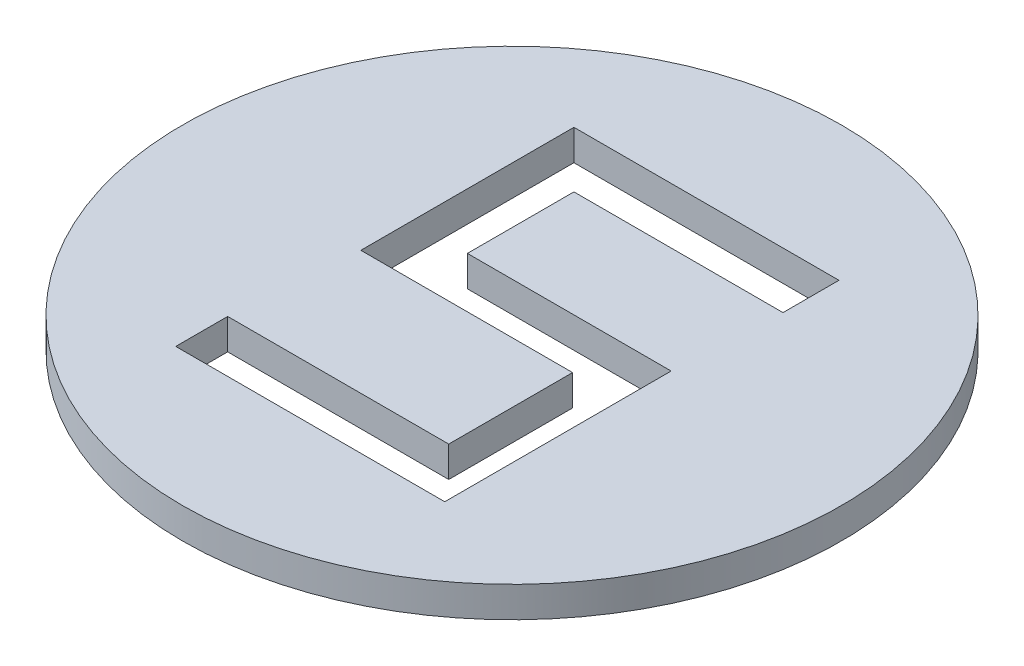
ISO-10303-21;
HEADER;
FILE_DESCRIPTION(('STEP AP214'),'2;1');
FILE_NAME('part.step','',(''),(''),'','','');
FILE_SCHEMA(('AUTOMOTIVE_DESIGN { 1 0 10303 214 1 1 1 1 }'));
ENDSEC;
DATA;
#1=APPLICATION_CONTEXT('core data for automotive mechanical design processes');
#2=APPLICATION_PROTOCOL_DEFINITION('international standard','automotive_design',2000,#1);
#3=PRODUCT_CONTEXT('',#1,'mechanical');
#4=PRODUCT('Part','Part','',(#3));
#5=PRODUCT_RELATED_PRODUCT_CATEGORY('part','',(#4));
#6=PRODUCT_DEFINITION_FORMATION('','',#4);
#7=PRODUCT_DEFINITION_CONTEXT('part definition',#1,'design');
#8=PRODUCT_DEFINITION('design','',#6,#7);
#9=PRODUCT_DEFINITION_SHAPE('','',#8);
#10=(LENGTH_UNIT() NAMED_UNIT(*) SI_UNIT(.MILLI.,.METRE.));
#11=(NAMED_UNIT(*) PLANE_ANGLE_UNIT() SI_UNIT($,.RADIAN.));
#12=(NAMED_UNIT(*) SI_UNIT($,.STERADIAN.) SOLID_ANGLE_UNIT());
#13=UNCERTAINTY_MEASURE_WITH_UNIT(LENGTH_MEASURE(1.E-05),#10,'distance_accuracy_value','');
#14=(GEOMETRIC_REPRESENTATION_CONTEXT(3) GLOBAL_UNCERTAINTY_ASSIGNED_CONTEXT((#13)) GLOBAL_UNIT_ASSIGNED_CONTEXT((#10,
#11,#12)) REPRESENTATION_CONTEXT('',''));
#15=CARTESIAN_POINT('',(0.,0.,0.));
#16=DIRECTION('',(0.,0.,1.));
#17=DIRECTION('',(1.,0.,0.));
#18=AXIS2_PLACEMENT_3D('',#15,#16,#17);
#19=CARTESIAN_POINT('',(0.,4.,-7.73154760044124));
#20=DIRECTION('',(0.,-1.,0.));
#21=DIRECTION('',(0.,0.,-1.));
#22=AXIS2_PLACEMENT_3D('',#19,#20,#21);
#23=CYLINDRICAL_SURFACE('',#22,42.9395292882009);
#24=CARTESIAN_POINT('',(0.,4.,-7.73154760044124));
#25=DIRECTION('',(0.,1.,0.));
#26=DIRECTION('',(0.,0.,1.));
#27=AXIS2_PLACEMENT_3D('',#24,#25,#26);
#28=CIRCLE('',#27,42.9395292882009);
#29=CARTESIAN_POINT('',(0.,4.,35.2079816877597));
#30=VERTEX_POINT('',#29);
#31=EDGE_CURVE('E11',#30,#30,#28,.T.);
#32=ORIENTED_EDGE('',*,*,#31,.F.);
#33=EDGE_LOOP('',(#32));
#34=FACE_BOUND('',#33,.T.);
#35=CARTESIAN_POINT('',(0.,0.,-7.73154760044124));
#36=DIRECTION('',(0.,1.,0.));
#37=DIRECTION('',(0.,0.,1.));
#38=AXIS2_PLACEMENT_3D('',#35,#36,#37);
#39=CIRCLE('',#38,42.9395292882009);
#40=CARTESIAN_POINT('',(0.,0.,35.2079816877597));
#41=VERTEX_POINT('',#40);
#42=EDGE_CURVE('E36',#41,#41,#39,.T.);
#43=ORIENTED_EDGE('',*,*,#42,.T.);
#44=EDGE_LOOP('',(#43));
#45=FACE_BOUND('',#44,.T.);
#46=ADVANCED_FACE('F33',(#34,#45),#23,.T.);
#47=CARTESIAN_POINT('',(0.,4.,-7.73154760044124));
#48=DIRECTION('',(0.,1.,0.));
#49=DIRECTION('',(0.,0.,1.));
#50=AXIS2_PLACEMENT_3D('',#47,#48,#49);
#51=PLANE('',#50);
#52=DIRECTION('',(0.,0.,-1.));
#53=VECTOR('',#52,1.);
#54=CARTESIAN_POINT('',(17.3517805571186,4.,-25.690640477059));
#55=LINE('',#54,#53);
#56=CARTESIAN_POINT('',(17.3517805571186,4.,-25.690640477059));
#57=VERTEX_POINT('',#56);
#58=CARTESIAN_POINT('',(17.3517805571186,4.,-32.9783883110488));
#59=VERTEX_POINT('',#58);
#60=EDGE_CURVE('E47',#57,#59,#55,.T.);
#61=ORIENTED_EDGE('',*,*,#60,.F.);
#62=DIRECTION('',(1.,0.,0.));
#63=VECTOR('',#62,1.);
#64=CARTESIAN_POINT('',(17.3517805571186,4.,-25.690640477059));
#65=LINE('',#64,#63);
#66=CARTESIAN_POINT('',(-9.8905149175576,4.,-25.690640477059));
#67=VERTEX_POINT('',#66);
#68=EDGE_CURVE('E140',#67,#57,#65,.T.);
#69=ORIENTED_EDGE('',*,*,#68,.F.);
#70=DIRECTION('',(0.,0.,-1.));
#71=VECTOR('',#70,1.);
#72=CARTESIAN_POINT('',(-9.8905149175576,4.,-25.690640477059));
#73=LINE('',#72,#71);
#74=CARTESIAN_POINT('',(-9.8905149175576,4.,-11.8092160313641));
#75=VERTEX_POINT('',#74);
#76=EDGE_CURVE('E143',#75,#67,#73,.T.);
#77=ORIENTED_EDGE('',*,*,#76,.F.);
#78=DIRECTION('',(-1.,0.,0.));
#79=VECTOR('',#78,1.);
#80=CARTESIAN_POINT('',(-9.8905149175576,4.,-11.8092160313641));
#81=LINE('',#80,#79);
#82=CARTESIAN_POINT('',(16.6577093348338,4.,-11.8092160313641));
#83=VERTEX_POINT('',#82);
#84=EDGE_CURVE('E195',#83,#75,#81,.T.);
#85=ORIENTED_EDGE('',*,*,#84,.F.);
#86=DIRECTION('',(0.,0.,-1.));
#87=VECTOR('',#86,1.);
#88=CARTESIAN_POINT('',(16.6577093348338,4.,-11.8092160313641));
#89=LINE('',#88,#87);
#90=CARTESIAN_POINT('',(16.6577093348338,4.,17.6888109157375));
#91=VERTEX_POINT('',#90);
#92=EDGE_CURVE('E192',#91,#83,#89,.T.);
#93=ORIENTED_EDGE('',*,*,#92,.F.);
#94=DIRECTION('',(1.,0.,0.));
#95=VECTOR('',#94,1.);
#96=CARTESIAN_POINT('',(16.6577093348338,4.,17.6888109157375));
#97=LINE('',#96,#95);
#98=CARTESIAN_POINT('',(-18.3928873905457,4.,17.6888109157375));
#99=VERTEX_POINT('',#98);
#100=EDGE_CURVE('E189',#99,#91,#97,.T.);
#101=ORIENTED_EDGE('',*,*,#100,.F.);
#102=DIRECTION('',(0.,0.,1.));
#103=VECTOR('',#102,1.);
#104=CARTESIAN_POINT('',(-18.3928873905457,4.,17.6888109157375));
#105=LINE('',#104,#103);
#106=CARTESIAN_POINT('',(-18.3928873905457,4.,10.9216164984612));
#107=VERTEX_POINT('',#106);
#108=EDGE_CURVE('E186',#107,#99,#105,.T.);
#109=ORIENTED_EDGE('',*,*,#108,.F.);
#110=DIRECTION('',(-1.,0.,0.));
#111=VECTOR('',#110,1.);
#112=CARTESIAN_POINT('',(10.4110683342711,4.,10.9216164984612));
#113=LINE('',#112,#111);
#114=CARTESIAN_POINT('',(10.4110683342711,4.,10.9216164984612));
#115=VERTEX_POINT('',#114);
#116=EDGE_CURVE('E183',#115,#107,#113,.T.);
#117=ORIENTED_EDGE('',*,*,#116,.F.);
#118=DIRECTION('',(0.,0.,1.));
#119=VECTOR('',#118,1.);
#120=CARTESIAN_POINT('',(10.4110683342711,4.,-5.21553941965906));
#121=LINE('',#120,#119);
#122=CARTESIAN_POINT('',(10.4110683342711,4.,-5.21553941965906));
#123=VERTEX_POINT('',#122);
#124=EDGE_CURVE('E180',#123,#115,#121,.T.);
#125=ORIENTED_EDGE('',*,*,#124,.F.);
#126=DIRECTION('',(1.,0.,0.));
#127=VECTOR('',#126,1.);
#128=CARTESIAN_POINT('',(-17.1782627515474,4.,-5.21553941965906));
#129=LINE('',#128,#127);
#130=CARTESIAN_POINT('',(-17.1782627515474,4.,-5.21553941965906));
#131=VERTEX_POINT('',#130);
#132=EDGE_CURVE('E177',#131,#123,#129,.T.);
#133=ORIENTED_EDGE('',*,*,#132,.F.);
#134=DIRECTION('',(0.,0.,1.));
#135=VECTOR('',#134,1.);
#136=CARTESIAN_POINT('',(-17.1782627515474,4.,-32.9783883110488));
#137=LINE('',#136,#135);
#138=CARTESIAN_POINT('',(-17.1782627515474,4.,-32.9783883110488));
#139=VERTEX_POINT('',#138);
#140=EDGE_CURVE('E174',#139,#131,#137,.T.);
#141=ORIENTED_EDGE('',*,*,#140,.F.);
#142=DIRECTION('',(-1.,0.,0.));
#143=VECTOR('',#142,1.);
#144=CARTESIAN_POINT('',(17.3517805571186,4.,-32.9783883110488));
#145=LINE('',#144,#143);
#146=EDGE_CURVE('E172',#59,#139,#145,.T.);
#147=ORIENTED_EDGE('',*,*,#146,.F.);
#148=EDGE_LOOP('',(#61,#69,#77,#85,#93,#101,#109,#117,#125,#133,#141,#147));
#149=FACE_BOUND('',#148,.T.);
#150=ORIENTED_EDGE('',*,*,#31,.T.);
#151=EDGE_LOOP('',(#150));
#152=FACE_BOUND('',#151,.T.);
#153=ADVANCED_FACE('F224',(#149,#152),#51,.T.);
#154=CARTESIAN_POINT('',(0.,0.,-7.73154760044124));
#155=DIRECTION('',(0.,1.,0.));
#156=DIRECTION('',(0.,0.,1.));
#157=AXIS2_PLACEMENT_3D('',#154,#155,#156);
#158=PLANE('',#157);
#159=DIRECTION('',(1.,0.,0.));
#160=VECTOR('',#159,1.);
#161=CARTESIAN_POINT('',(17.3517805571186,0.,-25.690640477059));
#162=LINE('',#161,#160);
#163=CARTESIAN_POINT('',(-9.8905149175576,0.,-25.690640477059));
#164=VERTEX_POINT('',#163);
#165=CARTESIAN_POINT('',(17.3517805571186,0.,-25.690640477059));
#166=VERTEX_POINT('',#165);
#167=EDGE_CURVE('E129',#164,#166,#162,.T.);
#168=ORIENTED_EDGE('',*,*,#167,.T.);
#169=DIRECTION('',(0.,0.,-1.));
#170=VECTOR('',#169,1.);
#171=CARTESIAN_POINT('',(17.3517805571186,0.,-25.690640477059));
#172=LINE('',#171,#170);
#173=CARTESIAN_POINT('',(17.3517805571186,0.,-32.9783883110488));
#174=VERTEX_POINT('',#173);
#175=EDGE_CURVE('E123',#166,#174,#172,.T.);
#176=ORIENTED_EDGE('',*,*,#175,.T.);
#177=DIRECTION('',(-1.,0.,0.));
#178=VECTOR('',#177,1.);
#179=CARTESIAN_POINT('',(17.3517805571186,0.,-32.9783883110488));
#180=LINE('',#179,#178);
#181=CARTESIAN_POINT('',(-17.1782627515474,0.,-32.9783883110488));
#182=VERTEX_POINT('',#181);
#183=EDGE_CURVE('E132',#174,#182,#180,.T.);
#184=ORIENTED_EDGE('',*,*,#183,.T.);
#185=DIRECTION('',(0.,0.,1.));
#186=VECTOR('',#185,1.);
#187=CARTESIAN_POINT('',(-17.1782627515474,0.,-32.9783883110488));
#188=LINE('',#187,#186);
#189=CARTESIAN_POINT('',(-17.1782627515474,0.,-5.21553941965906));
#190=VERTEX_POINT('',#189);
#191=EDGE_CURVE('E55',#182,#190,#188,.T.);
#192=ORIENTED_EDGE('',*,*,#191,.T.);
#193=DIRECTION('',(1.,0.,0.));
#194=VECTOR('',#193,1.);
#195=CARTESIAN_POINT('',(-17.1782627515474,0.,-5.21553941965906));
#196=LINE('',#195,#194);
#197=CARTESIAN_POINT('',(10.4110683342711,0.,-5.21553941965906));
#198=VERTEX_POINT('',#197);
#199=EDGE_CURVE('E147',#190,#198,#196,.T.);
#200=ORIENTED_EDGE('',*,*,#199,.T.);
#201=DIRECTION('',(0.,0.,1.));
#202=VECTOR('',#201,1.);
#203=CARTESIAN_POINT('',(10.4110683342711,0.,-5.21553941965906));
#204=LINE('',#203,#202);
#205=CARTESIAN_POINT('',(10.4110683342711,0.,10.9216164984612));
#206=VERTEX_POINT('',#205);
#207=EDGE_CURVE('E150',#198,#206,#204,.T.);
#208=ORIENTED_EDGE('',*,*,#207,.T.);
#209=DIRECTION('',(-1.,0.,0.));
#210=VECTOR('',#209,1.);
#211=CARTESIAN_POINT('',(10.4110683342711,0.,10.9216164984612));
#212=LINE('',#211,#210);
#213=CARTESIAN_POINT('',(-18.3928873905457,0.,10.9216164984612));
#214=VERTEX_POINT('',#213);
#215=EDGE_CURVE('E153',#206,#214,#212,.T.);
#216=ORIENTED_EDGE('',*,*,#215,.T.);
#217=DIRECTION('',(0.,0.,1.));
#218=VECTOR('',#217,1.);
#219=CARTESIAN_POINT('',(-18.3928873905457,0.,17.6888109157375));
#220=LINE('',#219,#218);
#221=CARTESIAN_POINT('',(-18.3928873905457,0.,17.6888109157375));
#222=VERTEX_POINT('',#221);
#223=EDGE_CURVE('E156',#214,#222,#220,.T.);
#224=ORIENTED_EDGE('',*,*,#223,.T.);
#225=DIRECTION('',(1.,0.,0.));
#226=VECTOR('',#225,1.);
#227=CARTESIAN_POINT('',(16.6577093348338,0.,17.6888109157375));
#228=LINE('',#227,#226);
#229=CARTESIAN_POINT('',(16.6577093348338,0.,17.6888109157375));
#230=VERTEX_POINT('',#229);
#231=EDGE_CURVE('E159',#222,#230,#228,.T.);
#232=ORIENTED_EDGE('',*,*,#231,.T.);
#233=DIRECTION('',(0.,0.,-1.));
#234=VECTOR('',#233,1.);
#235=CARTESIAN_POINT('',(16.6577093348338,0.,-11.8092160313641));
#236=LINE('',#235,#234);
#237=CARTESIAN_POINT('',(16.6577093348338,0.,-11.8092160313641));
#238=VERTEX_POINT('',#237);
#239=EDGE_CURVE('E162',#230,#238,#236,.T.);
#240=ORIENTED_EDGE('',*,*,#239,.T.);
#241=DIRECTION('',(-1.,0.,0.));
#242=VECTOR('',#241,1.);
#243=CARTESIAN_POINT('',(-9.8905149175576,0.,-11.8092160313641));
#244=LINE('',#243,#242);
#245=CARTESIAN_POINT('',(-9.8905149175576,0.,-11.8092160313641));
#246=VERTEX_POINT('',#245);
#247=EDGE_CURVE('E165',#238,#246,#244,.T.);
#248=ORIENTED_EDGE('',*,*,#247,.T.);
#249=DIRECTION('',(0.,0.,-1.));
#250=VECTOR('',#249,1.);
#251=CARTESIAN_POINT('',(-9.8905149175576,0.,-25.690640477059));
#252=LINE('',#251,#250);
#253=EDGE_CURVE('E168',#246,#164,#252,.T.);
#254=ORIENTED_EDGE('',*,*,#253,.T.);
#255=EDGE_LOOP('',(#168,#176,#184,#192,#200,#208,#216,#224,#232,#240,#248,#254));
#256=FACE_BOUND('',#255,.T.);
#257=ORIENTED_EDGE('',*,*,#42,.F.);
#258=EDGE_LOOP('',(#257));
#259=FACE_BOUND('',#258,.T.);
#260=ADVANCED_FACE('F136',(#256,#259),#158,.F.);
#261=CARTESIAN_POINT('',(17.3517805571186,0.,-25.690640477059));
#262=DIRECTION('',(1.,0.,0.));
#263=DIRECTION('',(0.,0.,-1.));
#264=AXIS2_PLACEMENT_3D('',#261,#262,#263);
#265=PLANE('',#264);
#266=ORIENTED_EDGE('',*,*,#60,.T.);
#267=DIRECTION('',(0.,1.,0.));
#268=VECTOR('',#267,1.);
#269=CARTESIAN_POINT('',(17.3517805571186,0.,-32.9783883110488));
#270=LINE('',#269,#268);
#271=EDGE_CURVE('E119',#174,#59,#270,.T.);
#272=ORIENTED_EDGE('',*,*,#271,.F.);
#273=ORIENTED_EDGE('',*,*,#175,.F.);
#274=DIRECTION('',(0.,1.,0.));
#275=VECTOR('',#274,1.);
#276=CARTESIAN_POINT('',(17.3517805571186,0.,-25.690640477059));
#277=LINE('',#276,#275);
#278=EDGE_CURVE('E200',#166,#57,#277,.T.);
#279=ORIENTED_EDGE('',*,*,#278,.T.);
#280=EDGE_LOOP('',(#266,#272,#273,#279));
#281=FACE_BOUND('',#280,.T.);
#282=ADVANCED_FACE('F121',(#281),#265,.F.);
#283=CARTESIAN_POINT('',(17.3517805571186,0.,-25.690640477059));
#284=DIRECTION('',(0.,0.,1.));
#285=DIRECTION('',(1.,0.,0.));
#286=AXIS2_PLACEMENT_3D('',#283,#284,#285);
#287=PLANE('',#286);
#288=ORIENTED_EDGE('',*,*,#68,.T.);
#289=ORIENTED_EDGE('',*,*,#278,.F.);
#290=ORIENTED_EDGE('',*,*,#167,.F.);
#291=DIRECTION('',(0.,1.,0.));
#292=VECTOR('',#291,1.);
#293=CARTESIAN_POINT('',(-9.8905149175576,0.,-25.690640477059));
#294=LINE('',#293,#292);
#295=EDGE_CURVE('E202',#164,#67,#294,.T.);
#296=ORIENTED_EDGE('',*,*,#295,.T.);
#297=EDGE_LOOP('',(#288,#289,#290,#296));
#298=FACE_BOUND('',#297,.T.);
#299=ADVANCED_FACE('F259',(#298),#287,.F.);
#300=CARTESIAN_POINT('',(-9.8905149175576,0.,-25.690640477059));
#301=DIRECTION('',(1.,0.,0.));
#302=DIRECTION('',(0.,0.,-1.));
#303=AXIS2_PLACEMENT_3D('',#300,#301,#302);
#304=PLANE('',#303);
#305=ORIENTED_EDGE('',*,*,#76,.T.);
#306=ORIENTED_EDGE('',*,*,#295,.F.);
#307=ORIENTED_EDGE('',*,*,#253,.F.);
#308=DIRECTION('',(0.,1.,0.));
#309=VECTOR('',#308,1.);
#310=CARTESIAN_POINT('',(-9.8905149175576,0.,-11.8092160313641));
#311=LINE('',#310,#309);
#312=EDGE_CURVE('E204',#246,#75,#311,.T.);
#313=ORIENTED_EDGE('',*,*,#312,.T.);
#314=EDGE_LOOP('',(#305,#306,#307,#313));
#315=FACE_BOUND('',#314,.T.);
#316=ADVANCED_FACE('F255',(#315),#304,.F.);
#317=CARTESIAN_POINT('',(-9.8905149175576,0.,-11.8092160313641));
#318=DIRECTION('',(0.,0.,-1.));
#319=DIRECTION('',(-1.,0.,0.));
#320=AXIS2_PLACEMENT_3D('',#317,#318,#319);
#321=PLANE('',#320);
#322=ORIENTED_EDGE('',*,*,#84,.T.);
#323=ORIENTED_EDGE('',*,*,#312,.F.);
#324=ORIENTED_EDGE('',*,*,#247,.F.);
#325=DIRECTION('',(0.,1.,0.));
#326=VECTOR('',#325,1.);
#327=CARTESIAN_POINT('',(16.6577093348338,0.,-11.8092160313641));
#328=LINE('',#327,#326);
#329=EDGE_CURVE('E206',#238,#83,#328,.T.);
#330=ORIENTED_EDGE('',*,*,#329,.T.);
#331=EDGE_LOOP('',(#322,#323,#324,#330));
#332=FACE_BOUND('',#331,.T.);
#333=ADVANCED_FACE('F252',(#332),#321,.F.);
#334=CARTESIAN_POINT('',(16.6577093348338,0.,-11.8092160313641));
#335=DIRECTION('',(1.,0.,0.));
#336=DIRECTION('',(0.,0.,-1.));
#337=AXIS2_PLACEMENT_3D('',#334,#335,#336);
#338=PLANE('',#337);
#339=ORIENTED_EDGE('',*,*,#92,.T.);
#340=ORIENTED_EDGE('',*,*,#329,.F.);
#341=ORIENTED_EDGE('',*,*,#239,.F.);
#342=DIRECTION('',(0.,1.,0.));
#343=VECTOR('',#342,1.);
#344=CARTESIAN_POINT('',(16.6577093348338,0.,17.6888109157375));
#345=LINE('',#344,#343);
#346=EDGE_CURVE('E208',#230,#91,#345,.T.);
#347=ORIENTED_EDGE('',*,*,#346,.T.);
#348=EDGE_LOOP('',(#339,#340,#341,#347));
#349=FACE_BOUND('',#348,.T.);
#350=ADVANCED_FACE('F248',(#349),#338,.F.);
#351=CARTESIAN_POINT('',(16.6577093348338,0.,17.6888109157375));
#352=DIRECTION('',(0.,0.,1.));
#353=DIRECTION('',(1.,0.,0.));
#354=AXIS2_PLACEMENT_3D('',#351,#352,#353);
#355=PLANE('',#354);
#356=ORIENTED_EDGE('',*,*,#100,.T.);
#357=ORIENTED_EDGE('',*,*,#346,.F.);
#358=ORIENTED_EDGE('',*,*,#231,.F.);
#359=DIRECTION('',(0.,1.,0.));
#360=VECTOR('',#359,1.);
#361=CARTESIAN_POINT('',(-18.3928873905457,0.,17.6888109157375));
#362=LINE('',#361,#360);
#363=EDGE_CURVE('E210',#222,#99,#362,.T.);
#364=ORIENTED_EDGE('',*,*,#363,.T.);
#365=EDGE_LOOP('',(#356,#357,#358,#364));
#366=FACE_BOUND('',#365,.T.);
#367=ADVANCED_FACE('F244',(#366),#355,.F.);
#368=CARTESIAN_POINT('',(-18.3928873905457,0.,17.6888109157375));
#369=DIRECTION('',(-1.,0.,0.));
#370=DIRECTION('',(0.,0.,1.));
#371=AXIS2_PLACEMENT_3D('',#368,#369,#370);
#372=PLANE('',#371);
#373=ORIENTED_EDGE('',*,*,#108,.T.);
#374=ORIENTED_EDGE('',*,*,#363,.F.);
#375=ORIENTED_EDGE('',*,*,#223,.F.);
#376=DIRECTION('',(0.,1.,0.));
#377=VECTOR('',#376,1.);
#378=CARTESIAN_POINT('',(-18.3928873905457,0.,10.9216164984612));
#379=LINE('',#378,#377);
#380=EDGE_CURVE('E212',#214,#107,#379,.T.);
#381=ORIENTED_EDGE('',*,*,#380,.T.);
#382=EDGE_LOOP('',(#373,#374,#375,#381));
#383=FACE_BOUND('',#382,.T.);
#384=ADVANCED_FACE('F240',(#383),#372,.F.);
#385=CARTESIAN_POINT('',(10.4110683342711,0.,10.9216164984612));
#386=DIRECTION('',(0.,0.,-1.));
#387=DIRECTION('',(-1.,0.,0.));
#388=AXIS2_PLACEMENT_3D('',#385,#386,#387);
#389=PLANE('',#388);
#390=ORIENTED_EDGE('',*,*,#116,.T.);
#391=ORIENTED_EDGE('',*,*,#380,.F.);
#392=ORIENTED_EDGE('',*,*,#215,.F.);
#393=DIRECTION('',(0.,1.,0.));
#394=VECTOR('',#393,1.);
#395=CARTESIAN_POINT('',(10.4110683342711,0.,10.9216164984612));
#396=LINE('',#395,#394);
#397=EDGE_CURVE('E214',#206,#115,#396,.T.);
#398=ORIENTED_EDGE('',*,*,#397,.T.);
#399=EDGE_LOOP('',(#390,#391,#392,#398));
#400=FACE_BOUND('',#399,.T.);
#401=ADVANCED_FACE('F236',(#400),#389,.F.);
#402=CARTESIAN_POINT('',(10.4110683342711,0.,-5.21553941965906));
#403=DIRECTION('',(-1.,0.,0.));
#404=DIRECTION('',(0.,0.,1.));
#405=AXIS2_PLACEMENT_3D('',#402,#403,#404);
#406=PLANE('',#405);
#407=ORIENTED_EDGE('',*,*,#124,.T.);
#408=ORIENTED_EDGE('',*,*,#397,.F.);
#409=ORIENTED_EDGE('',*,*,#207,.F.);
#410=DIRECTION('',(0.,1.,0.));
#411=VECTOR('',#410,1.);
#412=CARTESIAN_POINT('',(10.4110683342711,0.,-5.21553941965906));
#413=LINE('',#412,#411);
#414=EDGE_CURVE('E216',#198,#123,#413,.T.);
#415=ORIENTED_EDGE('',*,*,#414,.T.);
#416=EDGE_LOOP('',(#407,#408,#409,#415));
#417=FACE_BOUND('',#416,.T.);
#418=ADVANCED_FACE('F234',(#417),#406,.F.);
#419=CARTESIAN_POINT('',(-17.1782627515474,0.,-5.21553941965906));
#420=DIRECTION('',(0.,0.,1.));
#421=DIRECTION('',(1.,0.,0.));
#422=AXIS2_PLACEMENT_3D('',#419,#420,#421);
#423=PLANE('',#422);
#424=ORIENTED_EDGE('',*,*,#132,.T.);
#425=ORIENTED_EDGE('',*,*,#414,.F.);
#426=ORIENTED_EDGE('',*,*,#199,.F.);
#427=DIRECTION('',(0.,1.,0.));
#428=VECTOR('',#427,1.);
#429=CARTESIAN_POINT('',(-17.1782627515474,0.,-5.21553941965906));
#430=LINE('',#429,#428);
#431=EDGE_CURVE('E218',#190,#131,#430,.T.);
#432=ORIENTED_EDGE('',*,*,#431,.T.);
#433=EDGE_LOOP('',(#424,#425,#426,#432));
#434=FACE_BOUND('',#433,.T.);
#435=ADVANCED_FACE('F229',(#434),#423,.F.);
#436=CARTESIAN_POINT('',(-17.1782627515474,0.,-32.9783883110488));
#437=DIRECTION('',(-1.,0.,0.));
#438=DIRECTION('',(0.,0.,1.));
#439=AXIS2_PLACEMENT_3D('',#436,#437,#438);
#440=PLANE('',#439);
#441=ORIENTED_EDGE('',*,*,#140,.T.);
#442=ORIENTED_EDGE('',*,*,#431,.F.);
#443=ORIENTED_EDGE('',*,*,#191,.F.);
#444=DIRECTION('',(0.,1.,0.));
#445=VECTOR('',#444,1.);
#446=CARTESIAN_POINT('',(-17.1782627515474,0.,-32.9783883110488));
#447=LINE('',#446,#445);
#448=EDGE_CURVE('E128',#182,#139,#447,.T.);
#449=ORIENTED_EDGE('',*,*,#448,.T.);
#450=EDGE_LOOP('',(#441,#442,#443,#449));
#451=FACE_BOUND('',#450,.T.);
#452=ADVANCED_FACE('F220',(#451),#440,.F.);
#453=CARTESIAN_POINT('',(17.3517805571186,0.,-32.9783883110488));
#454=DIRECTION('',(0.,0.,-1.));
#455=DIRECTION('',(-1.,0.,0.));
#456=AXIS2_PLACEMENT_3D('',#453,#454,#455);
#457=PLANE('',#456);
#458=ORIENTED_EDGE('',*,*,#146,.T.);
#459=ORIENTED_EDGE('',*,*,#448,.F.);
#460=ORIENTED_EDGE('',*,*,#183,.F.);
#461=ORIENTED_EDGE('',*,*,#271,.T.);
#462=EDGE_LOOP('',(#458,#459,#460,#461));
#463=FACE_BOUND('',#462,.T.);
#464=ADVANCED_FACE('F133',(#463),#457,.F.);
#465=CLOSED_SHELL('',(#46,#153,#260,#282,#299,#316,#333,#350,#367,#384,#401,#418,#435,#452,#464));
#466=MANIFOLD_SOLID_BREP('B2',#465);
#467=ADVANCED_BREP_SHAPE_REPRESENTATION('',(#18,#466),#14);
#468=SHAPE_DEFINITION_REPRESENTATION(#9,#467);
ENDSEC;
END-ISO-10303-21;
